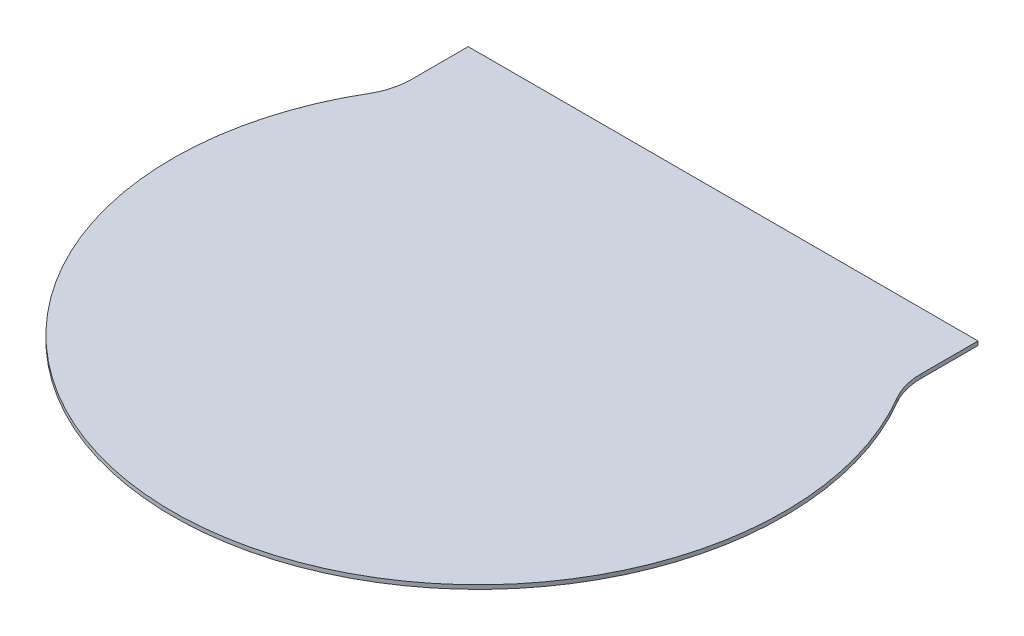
ISO-10303-21;
HEADER;
FILE_DESCRIPTION(('STEP AP214'),'2;1');
FILE_NAME('part.step','',(''),(''),'','','');
FILE_SCHEMA(('AUTOMOTIVE_DESIGN { 1 0 10303 214 1 1 1 1 }'));
ENDSEC;
DATA;
#1=APPLICATION_CONTEXT('core data for automotive mechanical design processes');
#2=APPLICATION_PROTOCOL_DEFINITION('international standard','automotive_design',2000,#1);
#3=PRODUCT_CONTEXT('',#1,'mechanical');
#4=PRODUCT('Part','Part','',(#3));
#5=PRODUCT_RELATED_PRODUCT_CATEGORY('part','',(#4));
#6=PRODUCT_DEFINITION_FORMATION('','',#4);
#7=PRODUCT_DEFINITION_CONTEXT('part definition',#1,'design');
#8=PRODUCT_DEFINITION('design','',#6,#7);
#9=PRODUCT_DEFINITION_SHAPE('','',#8);
#10=(LENGTH_UNIT() NAMED_UNIT(*) SI_UNIT(.MILLI.,.METRE.));
#11=(NAMED_UNIT(*) PLANE_ANGLE_UNIT() SI_UNIT($,.RADIAN.));
#12=(NAMED_UNIT(*) SI_UNIT($,.STERADIAN.) SOLID_ANGLE_UNIT());
#13=UNCERTAINTY_MEASURE_WITH_UNIT(LENGTH_MEASURE(1.E-05),#10,'distance_accuracy_value','');
#14=(GEOMETRIC_REPRESENTATION_CONTEXT(3) GLOBAL_UNCERTAINTY_ASSIGNED_CONTEXT((#13)) GLOBAL_UNIT_ASSIGNED_CONTEXT((#10,
#11,#12)) REPRESENTATION_CONTEXT('',''));
#15=CARTESIAN_POINT('',(0.,0.,0.));
#16=DIRECTION('',(0.,0.,1.));
#17=DIRECTION('',(1.,0.,0.));
#18=AXIS2_PLACEMENT_3D('',#15,#16,#17);
#19=CARTESIAN_POINT('',(3.98779999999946,0.05,-2.33831798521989));
#20=DIRECTION('',(0.,-1.,0.));
#21=DIRECTION('',(0.,0.,-1.));
#22=AXIS2_PLACEMENT_3D('',#19,#20,#21);
#23=CYLINDRICAL_SURFACE('',#22,0.812799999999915);
#24=CARTESIAN_POINT('',(3.98779999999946,0.,-2.33831798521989));
#25=DIRECTION('',(0.,1.,0.));
#26=DIRECTION('',(0.,0.,1.));
#27=AXIS2_PLACEMENT_3D('',#24,#25,#26);
#28=CIRCLE('',#27,0.812799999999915);
#29=CARTESIAN_POINT('',(3.17499999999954,0.,-2.33831798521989));
#30=VERTEX_POINT('',#29);
#31=CARTESIAN_POINT('',(3.28664835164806,0.,-1.9271851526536));
#32=VERTEX_POINT('',#31);
#33=EDGE_CURVE('E111',#30,#32,#28,.T.);
#34=ORIENTED_EDGE('',*,*,#33,.F.);
#35=DIRECTION('',(0.,-1.,0.));
#36=VECTOR('',#35,1.);
#37=CARTESIAN_POINT('',(3.17499999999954,0.05,-2.33831798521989));
#38=LINE('',#37,#36);
#39=CARTESIAN_POINT('',(3.17499999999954,0.05,-2.33831798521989));
#40=VERTEX_POINT('',#39);
#41=EDGE_CURVE('E11',#40,#30,#38,.T.);
#42=ORIENTED_EDGE('',*,*,#41,.F.);
#43=CARTESIAN_POINT('',(3.98779999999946,0.05,-2.33831798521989));
#44=DIRECTION('',(0.,1.,0.));
#45=DIRECTION('',(0.,0.,1.));
#46=AXIS2_PLACEMENT_3D('',#43,#44,#45);
#47=CIRCLE('',#46,0.812799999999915);
#48=CARTESIAN_POINT('',(3.28664835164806,0.05,-1.9271851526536));
#49=VERTEX_POINT('',#48);
#50=EDGE_CURVE('E124',#40,#49,#47,.T.);
#51=ORIENTED_EDGE('',*,*,#50,.T.);
#52=DIRECTION('',(0.,-1.,0.));
#53=VECTOR('',#52,1.);
#54=CARTESIAN_POINT('',(3.28664835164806,0.05,-1.9271851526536));
#55=LINE('',#54,#53);
#56=EDGE_CURVE('E74',#49,#32,#55,.T.);
#57=ORIENTED_EDGE('',*,*,#56,.T.);
#58=EDGE_LOOP('',(#34,#42,#51,#57));
#59=FACE_BOUND('',#58,.T.);
#60=ADVANCED_FACE('F30',(#59),#23,.F.);
#61=CARTESIAN_POINT('',(3.17499999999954,0.05,0.380999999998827));
#62=DIRECTION('',(-1.,0.,0.));
#63=DIRECTION('',(0.,0.,1.));
#64=AXIS2_PLACEMENT_3D('',#61,#62,#63);
#65=PLANE('',#64);
#66=DIRECTION('',(0.,0.,-1.));
#67=VECTOR('',#66,1.);
#68=CARTESIAN_POINT('',(3.17499999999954,0.,0.380999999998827));
#69=LINE('',#68,#67);
#70=CARTESIAN_POINT('',(3.17499999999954,0.,-3.04800000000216));
#71=VERTEX_POINT('',#70);
#72=EDGE_CURVE('E114',#30,#71,#69,.T.);
#73=ORIENTED_EDGE('',*,*,#72,.T.);
#74=DIRECTION('',(0.,-1.,0.));
#75=VECTOR('',#74,1.);
#76=CARTESIAN_POINT('',(3.17499999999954,0.05,-3.04800000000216));
#77=LINE('',#76,#75);
#78=CARTESIAN_POINT('',(3.17499999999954,0.05,-3.04800000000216));
#79=VERTEX_POINT('',#78);
#80=EDGE_CURVE('E38',#79,#71,#77,.T.);
#81=ORIENTED_EDGE('',*,*,#80,.F.);
#82=DIRECTION('',(0.,0.,-1.));
#83=VECTOR('',#82,1.);
#84=CARTESIAN_POINT('',(3.17499999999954,0.05,0.380999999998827));
#85=LINE('',#84,#83);
#86=EDGE_CURVE('E137',#40,#79,#85,.T.);
#87=ORIENTED_EDGE('',*,*,#86,.F.);
#88=ORIENTED_EDGE('',*,*,#41,.T.);
#89=EDGE_LOOP('',(#73,#81,#87,#88));
#90=FACE_BOUND('',#89,.T.);
#91=ADVANCED_FACE('F140',(#90),#65,.F.);
#92=CARTESIAN_POINT('',(-8.1153426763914,0.05,-3.04800000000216));
#93=DIRECTION('',(0.,0.,1.));
#94=DIRECTION('',(1.,0.,0.));
#95=AXIS2_PLACEMENT_3D('',#92,#93,#94);
#96=PLANE('',#95);
#97=DIRECTION('',(-1.,0.,0.));
#98=VECTOR('',#97,1.);
#99=CARTESIAN_POINT('',(-8.1153426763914,0.,-3.04800000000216));
#100=LINE('',#99,#98);
#101=CARTESIAN_POINT('',(-3.17499999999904,0.,-3.04800000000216));
#102=VERTEX_POINT('',#101);
#103=EDGE_CURVE('E116',#71,#102,#100,.T.);
#104=ORIENTED_EDGE('',*,*,#103,.T.);
#105=DIRECTION('',(0.,-1.,0.));
#106=VECTOR('',#105,1.);
#107=CARTESIAN_POINT('',(-3.17499999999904,0.05,-3.04800000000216));
#108=LINE('',#107,#106);
#109=CARTESIAN_POINT('',(-3.17499999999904,0.05,-3.04800000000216));
#110=VERTEX_POINT('',#109);
#111=EDGE_CURVE('E98',#110,#102,#108,.T.);
#112=ORIENTED_EDGE('',*,*,#111,.F.);
#113=DIRECTION('',(-1.,0.,0.));
#114=VECTOR('',#113,1.);
#115=CARTESIAN_POINT('',(-8.1153426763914,0.05,-3.04800000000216));
#116=LINE('',#115,#114);
#117=EDGE_CURVE('E103',#79,#110,#116,.T.);
#118=ORIENTED_EDGE('',*,*,#117,.F.);
#119=ORIENTED_EDGE('',*,*,#80,.T.);
#120=EDGE_LOOP('',(#104,#112,#118,#119));
#121=FACE_BOUND('',#120,.T.);
#122=ADVANCED_FACE('F131',(#121),#96,.F.);
#123=CARTESIAN_POINT('',(-3.17499999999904,0.05,0.380999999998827));
#124=DIRECTION('',(-1.,0.,0.));
#125=DIRECTION('',(0.,0.,1.));
#126=AXIS2_PLACEMENT_3D('',#123,#124,#125);
#127=PLANE('',#126);
#128=DIRECTION('',(0.,0.,-1.));
#129=VECTOR('',#128,1.);
#130=CARTESIAN_POINT('',(-3.17499999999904,0.,0.380999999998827));
#131=LINE('',#130,#129);
#132=CARTESIAN_POINT('',(-3.17499999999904,0.,-2.33831798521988));
#133=VERTEX_POINT('',#132);
#134=EDGE_CURVE('E93',#133,#102,#131,.T.);
#135=ORIENTED_EDGE('',*,*,#134,.F.);
#136=DIRECTION('',(0.,-1.,0.));
#137=VECTOR('',#136,1.);
#138=CARTESIAN_POINT('',(-3.17499999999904,0.05,-2.33831798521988));
#139=LINE('',#138,#137);
#140=CARTESIAN_POINT('',(-3.17499999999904,0.05,-2.33831798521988));
#141=VERTEX_POINT('',#140);
#142=EDGE_CURVE('E88',#141,#133,#139,.T.);
#143=ORIENTED_EDGE('',*,*,#142,.F.);
#144=DIRECTION('',(0.,0.,-1.));
#145=VECTOR('',#144,1.);
#146=CARTESIAN_POINT('',(-3.17499999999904,0.05,0.380999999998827));
#147=LINE('',#146,#145);
#148=EDGE_CURVE('E91',#141,#110,#147,.T.);
#149=ORIENTED_EDGE('',*,*,#148,.T.);
#150=ORIENTED_EDGE('',*,*,#111,.T.);
#151=EDGE_LOOP('',(#135,#143,#149,#150));
#152=FACE_BOUND('',#151,.T.);
#153=ADVANCED_FACE('F90',(#152),#127,.T.);
#154=CARTESIAN_POINT('',(-3.98779999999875,0.05,-2.33831798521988));
#155=DIRECTION('',(0.,-1.,0.));
#156=DIRECTION('',(0.,0.,-1.));
#157=AXIS2_PLACEMENT_3D('',#154,#155,#156);
#158=CYLINDRICAL_SURFACE('',#157,0.812799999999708);
#159=CARTESIAN_POINT('',(-3.98779999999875,0.,-2.33831798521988));
#160=DIRECTION('',(0.,1.,0.));
#161=DIRECTION('',(0.,0.,1.));
#162=AXIS2_PLACEMENT_3D('',#159,#160,#161);
#163=CIRCLE('',#162,0.812799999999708);
#164=CARTESIAN_POINT('',(-3.28664835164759,0.,-1.9271851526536));
#165=VERTEX_POINT('',#164);
#166=EDGE_CURVE('E120',#165,#133,#163,.T.);
#167=ORIENTED_EDGE('',*,*,#166,.F.);
#168=DIRECTION('',(0.,-1.,0.));
#169=VECTOR('',#168,1.);
#170=CARTESIAN_POINT('',(-3.28664835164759,0.05,-1.9271851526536));
#171=LINE('',#170,#169);
#172=CARTESIAN_POINT('',(-3.28664835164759,0.05,-1.9271851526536));
#173=VERTEX_POINT('',#172);
#174=EDGE_CURVE('E67',#173,#165,#171,.T.);
#175=ORIENTED_EDGE('',*,*,#174,.F.);
#176=CARTESIAN_POINT('',(-3.98779999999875,0.05,-2.33831798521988));
#177=DIRECTION('',(0.,1.,0.));
#178=DIRECTION('',(0.,0.,1.));
#179=AXIS2_PLACEMENT_3D('',#176,#177,#178);
#180=CIRCLE('',#179,0.812799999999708);
#181=EDGE_CURVE('E101',#173,#141,#180,.T.);
#182=ORIENTED_EDGE('',*,*,#181,.T.);
#183=ORIENTED_EDGE('',*,*,#142,.T.);
#184=EDGE_LOOP('',(#167,#175,#182,#183));
#185=FACE_BOUND('',#184,.T.);
#186=ADVANCED_FACE('F106',(#185),#158,.F.);
#187=CARTESIAN_POINT('',(2.37223435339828E-13,0.05,0.));
#188=DIRECTION('',(0.,-1.,0.));
#189=DIRECTION('',(0.,0.,-1.));
#190=AXIS2_PLACEMENT_3D('',#187,#188,#189);
#191=CYLINDRICAL_SURFACE('',#190,3.80999999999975);
#192=CARTESIAN_POINT('',(2.37223435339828E-13,0.,0.));
#193=DIRECTION('',(0.,1.,0.));
#194=DIRECTION('',(0.,0.,1.));
#195=AXIS2_PLACEMENT_3D('',#192,#193,#194);
#196=CIRCLE('',#195,3.80999999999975);
#197=EDGE_CURVE('E122',#165,#32,#196,.T.);
#198=ORIENTED_EDGE('',*,*,#197,.T.);
#199=ORIENTED_EDGE('',*,*,#56,.F.);
#200=CARTESIAN_POINT('',(2.37223435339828E-13,0.05,0.));
#201=DIRECTION('',(0.,1.,0.));
#202=DIRECTION('',(0.,0.,1.));
#203=AXIS2_PLACEMENT_3D('',#200,#201,#202);
#204=CIRCLE('',#203,3.80999999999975);
#205=EDGE_CURVE('E46',#173,#49,#204,.T.);
#206=ORIENTED_EDGE('',*,*,#205,.F.);
#207=ORIENTED_EDGE('',*,*,#174,.T.);
#208=EDGE_LOOP('',(#198,#199,#206,#207));
#209=FACE_BOUND('',#208,.T.);
#210=ADVANCED_FACE('F136',(#209),#191,.T.);
#211=CARTESIAN_POINT('',(-8.1153426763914,0.05,0.380999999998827));
#212=DIRECTION('',(0.,1.,0.));
#213=DIRECTION('',(0.,0.,1.));
#214=AXIS2_PLACEMENT_3D('',#211,#212,#213);
#215=PLANE('',#214);
#216=ORIENTED_EDGE('',*,*,#50,.F.);
#217=ORIENTED_EDGE('',*,*,#86,.T.);
#218=ORIENTED_EDGE('',*,*,#117,.T.);
#219=ORIENTED_EDGE('',*,*,#148,.F.);
#220=ORIENTED_EDGE('',*,*,#181,.F.);
#221=ORIENTED_EDGE('',*,*,#205,.T.);
#222=EDGE_LOOP('',(#216,#217,#218,#219,#220,#221));
#223=FACE_BOUND('',#222,.T.);
#224=ADVANCED_FACE('F100',(#223),#215,.T.);
#225=CARTESIAN_POINT('',(-8.1153426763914,0.,0.380999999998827));
#226=DIRECTION('',(0.,1.,0.));
#227=DIRECTION('',(0.,0.,1.));
#228=AXIS2_PLACEMENT_3D('',#225,#226,#227);
#229=PLANE('',#228);
#230=ORIENTED_EDGE('',*,*,#33,.T.);
#231=ORIENTED_EDGE('',*,*,#197,.F.);
#232=ORIENTED_EDGE('',*,*,#166,.T.);
#233=ORIENTED_EDGE('',*,*,#134,.T.);
#234=ORIENTED_EDGE('',*,*,#103,.F.);
#235=ORIENTED_EDGE('',*,*,#72,.F.);
#236=EDGE_LOOP('',(#230,#231,#232,#233,#234,#235));
#237=FACE_BOUND('',#236,.T.);
#238=ADVANCED_FACE('F135',(#237),#229,.F.);
#239=CLOSED_SHELL('',(#60,#91,#122,#153,#186,#210,#224,#238));
#240=MANIFOLD_SOLID_BREP('B2',#239);
#241=ADVANCED_BREP_SHAPE_REPRESENTATION('',(#18,#240),#14);
#242=SHAPE_DEFINITION_REPRESENTATION(#9,#241);
ENDSEC;
END-ISO-10303-21;
